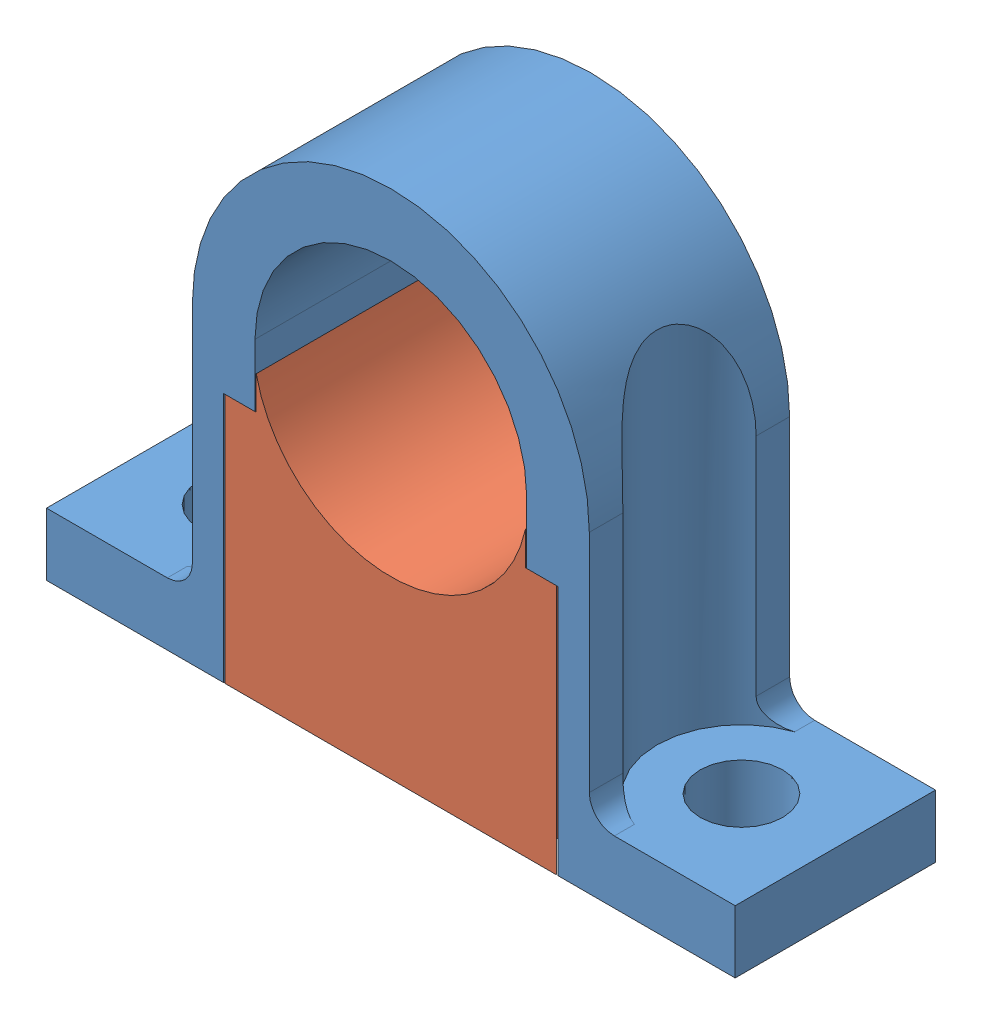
SolidWorks assembly Baugr2.sldasm, configuration Standard (file format 14000). Lengths in mm.
Overall size (55 40.85 16).
2 component instances, 2 part files, 3 mates.
Components (placement in the parent):
- Magazin_4_Zylinderhalterung_oben-1: Magazin_4_Zylinderhalterung_oben.SLDPRT [Standard] at (-1.5232 -18.8139 55) size (55 40.85 16)
- Magazin_4_Zylinderhalterung_unten-1: Magazin_4_Zylinderhalterung_unten.SLDPRT [Standard] at (-1.5232 -18.8139 55) size (26.5 22.67 16)
Mates (geometry in assembly coordinates):
- Symmetrisch1: symmetric: plane of assembly; plane of assembly; plane of Magazin_4_Zylinderhalterung_unten-1 through (9.2268 -18.8139 75.2141) normal (1 0 0); plane of Magazin_4_Zylinderhalterung_unten-1 through (-12.2732 -18.8139 75.2141) normal (-1 0 0); plane of assembly
- Deckungsgleich1: coincident: plane of Magazin_4_Zylinderhalterung_oben-1 through (-1.5232 -18.8139 71) normal (0 -1 0); plane of Magazin_4_Zylinderhalterung_unten-1 through (9.2268 -18.8139 75.2141) normal (0 -1 0)
- Deckungsgleich2: coincident aligned: plane of Magazin_4_Zylinderhalterung_oben-1 through (-1.5232 -18.8139 71) normal (0 0 1); plane of Magazin_4_Zylinderhalterung_unten-1 through (-1.5232 6.1861 71) normal (0 0 1)
